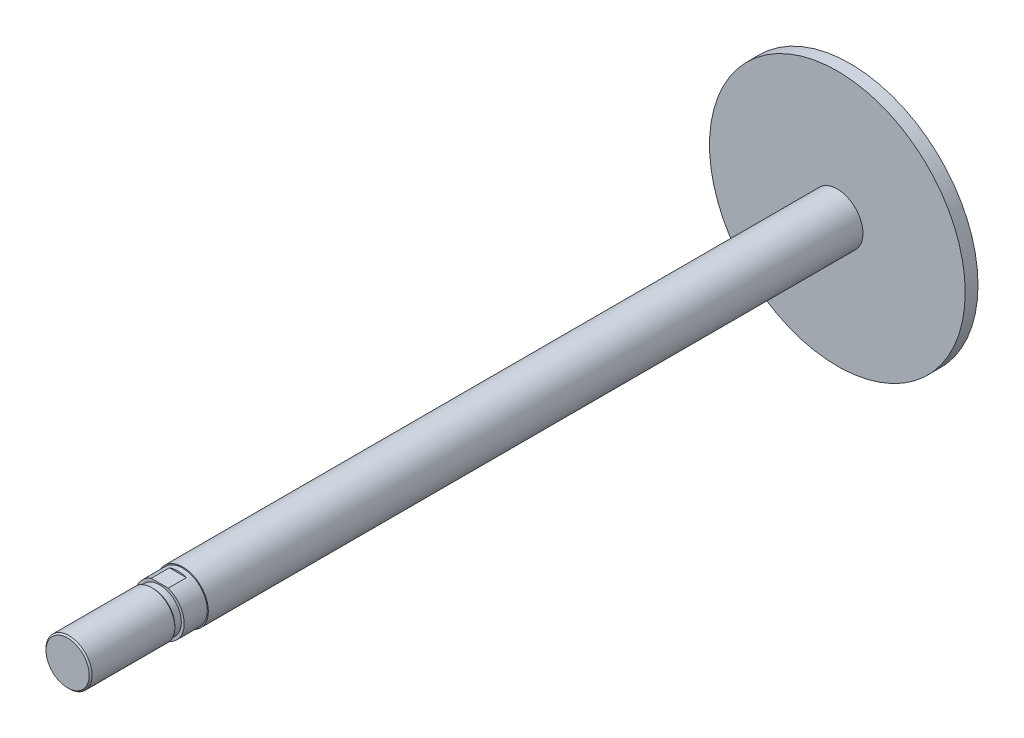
ISO-10303-21;
HEADER;
FILE_DESCRIPTION(('STEP AP214'),'2;1');
FILE_NAME('part.step','',(''),(''),'','','');
FILE_SCHEMA(('AUTOMOTIVE_DESIGN { 1 0 10303 214 1 1 1 1 }'));
ENDSEC;
DATA;
#1=APPLICATION_CONTEXT('core data for automotive mechanical design processes');
#2=APPLICATION_PROTOCOL_DEFINITION('international standard','automotive_design',2000,#1);
#3=PRODUCT_CONTEXT('',#1,'mechanical');
#4=PRODUCT('Part','Part','',(#3));
#5=PRODUCT_RELATED_PRODUCT_CATEGORY('part','',(#4));
#6=PRODUCT_DEFINITION_FORMATION('','',#4);
#7=PRODUCT_DEFINITION_CONTEXT('part definition',#1,'design');
#8=PRODUCT_DEFINITION('design','',#6,#7);
#9=PRODUCT_DEFINITION_SHAPE('','',#8);
#10=(LENGTH_UNIT() NAMED_UNIT(*) SI_UNIT(.MILLI.,.METRE.));
#11=(NAMED_UNIT(*) PLANE_ANGLE_UNIT() SI_UNIT($,.RADIAN.));
#12=(NAMED_UNIT(*) SI_UNIT($,.STERADIAN.) SOLID_ANGLE_UNIT());
#13=UNCERTAINTY_MEASURE_WITH_UNIT(LENGTH_MEASURE(1.E-05),#10,'distance_accuracy_value','');
#14=(GEOMETRIC_REPRESENTATION_CONTEXT(3) GLOBAL_UNCERTAINTY_ASSIGNED_CONTEXT((#13)) GLOBAL_UNIT_ASSIGNED_CONTEXT((#10,
#11,#12)) REPRESENTATION_CONTEXT('',''));
#15=CARTESIAN_POINT('',(0.,0.,0.));
#16=DIRECTION('',(0.,0.,1.));
#17=DIRECTION('',(1.,0.,0.));
#18=AXIS2_PLACEMENT_3D('',#15,#16,#17);
#19=CARTESIAN_POINT('',(0.,-10.,-445.));
#20=DIRECTION('',(0.,0.,-1.));
#21=DIRECTION('',(0.,-1.,0.));
#22=AXIS2_PLACEMENT_3D('',#19,#20,#21);
#23=PLANE('',#22);
#24=CARTESIAN_POINT('',(0.,0.,-445.));
#25=DIRECTION('',(0.,0.,-1.));
#26=DIRECTION('',(1.,0.,0.));
#27=AXIS2_PLACEMENT_3D('',#24,#25,#26);
#28=CIRCLE('',#27,100.);
#29=CARTESIAN_POINT('',(100.,0.,-445.));
#30=VERTEX_POINT('',#29);
#31=EDGE_CURVE('E97',#30,#30,#28,.T.);
#32=ORIENTED_EDGE('',*,*,#31,.T.);
#33=EDGE_LOOP('',(#32));
#34=FACE_BOUND('',#33,.T.);
#35=ADVANCED_FACE('F16',(#34),#23,.T.);
#36=CARTESIAN_POINT('',(0.,0.,-184.025));
#37=DIRECTION('',(0.,0.,1.));
#38=DIRECTION('',(0.,-1.,0.));
#39=AXIS2_PLACEMENT_3D('',#36,#37,#38);
#40=CYLINDRICAL_SURFACE('',#39,20.);
#41=CARTESIAN_POINT('',(0.,0.,76.95));
#42=DIRECTION('',(0.,0.,-1.));
#43=DIRECTION('',(0.,-1.,0.));
#44=AXIS2_PLACEMENT_3D('',#41,#42,#43);
#45=CIRCLE('',#44,20.);
#46=CARTESIAN_POINT('',(0.,-20.,76.95));
#47=VERTEX_POINT('',#46);
#48=EDGE_CURVE('E11',#47,#47,#45,.T.);
#49=ORIENTED_EDGE('',*,*,#48,.T.);
#50=EDGE_LOOP('',(#49));
#51=FACE_BOUND('',#50,.T.);
#52=CARTESIAN_POINT('',(0.,0.,-435.));
#53=DIRECTION('',(0.,0.,1.));
#54=DIRECTION('',(0.,-1.,0.));
#55=AXIS2_PLACEMENT_3D('',#52,#53,#54);
#56=CIRCLE('',#55,20.);
#57=CARTESIAN_POINT('',(0.,20.,-435.));
#58=VERTEX_POINT('',#57);
#59=EDGE_CURVE('E95',#58,#58,#56,.T.);
#60=ORIENTED_EDGE('',*,*,#59,.T.);
#61=EDGE_LOOP('',(#60));
#62=FACE_BOUND('',#61,.T.);
#63=ADVANCED_FACE('F161',(#51,#62),#40,.T.);
#64=CARTESIAN_POINT('',(0.,-19.6,76.95));
#65=DIRECTION('',(0.,0.,1.));
#66=DIRECTION('',(0.,1.,0.));
#67=AXIS2_PLACEMENT_3D('',#64,#65,#66);
#68=PLANE('',#67);
#69=CARTESIAN_POINT('',(0.,0.,76.95));
#70=DIRECTION('',(0.,0.,-1.));
#71=DIRECTION('',(0.,-1.,0.));
#72=AXIS2_PLACEMENT_3D('',#69,#70,#71);
#73=CIRCLE('',#72,19.2);
#74=CARTESIAN_POINT('',(0.,-19.2,76.95));
#75=VERTEX_POINT('',#74);
#76=EDGE_CURVE('E50',#75,#75,#73,.T.);
#77=ORIENTED_EDGE('',*,*,#76,.T.);
#78=EDGE_LOOP('',(#77));
#79=FACE_BOUND('',#78,.T.);
#80=ORIENTED_EDGE('',*,*,#48,.F.);
#81=EDGE_LOOP('',(#80));
#82=FACE_BOUND('',#81,.T.);
#83=ADVANCED_FACE('F166',(#79,#82),#68,.T.);
#84=CARTESIAN_POINT('',(0.,0.,97.52));
#85=DIRECTION('',(0.,0.,1.));
#86=DIRECTION('',(0.,-1.,0.));
#87=AXIS2_PLACEMENT_3D('',#84,#85,#86);
#88=CYLINDRICAL_SURFACE('',#87,16.9175);
#89=CARTESIAN_POINT('',(0.,0.,100.04));
#90=DIRECTION('',(0.,0.,-1.));
#91=DIRECTION('',(0.,-1.,0.));
#92=AXIS2_PLACEMENT_3D('',#89,#90,#91);
#93=CIRCLE('',#92,16.9175);
#94=CARTESIAN_POINT('',(0.,-16.9175,100.04));
#95=VERTEX_POINT('',#94);
#96=EDGE_CURVE('E26',#95,#95,#93,.T.);
#97=ORIENTED_EDGE('',*,*,#96,.T.);
#98=EDGE_LOOP('',(#97));
#99=FACE_BOUND('',#98,.T.);
#100=CARTESIAN_POINT('',(0.,0.,95.));
#101=DIRECTION('',(0.,0.,-1.));
#102=DIRECTION('',(0.,-1.,0.));
#103=AXIS2_PLACEMENT_3D('',#100,#101,#102);
#104=CIRCLE('',#103,16.9175);
#105=CARTESIAN_POINT('',(0.,-16.9175,95.));
#106=VERTEX_POINT('',#105);
#107=EDGE_CURVE('E98',#106,#106,#104,.T.);
#108=ORIENTED_EDGE('',*,*,#107,.F.);
#109=EDGE_LOOP('',(#108));
#110=FACE_BOUND('',#109,.T.);
#111=ADVANCED_FACE('F202',(#99,#110),#88,.T.);
#112=CARTESIAN_POINT('',(0.,0.,100.58125));
#113=DIRECTION('',(0.,0.,1.));
#114=DIRECTION('',(0.,-1.,0.));
#115=AXIS2_PLACEMENT_3D('',#112,#113,#114);
#116=CONICAL_SURFACE('',#115,17.45875,0.78539816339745);
#117=CARTESIAN_POINT('',(0.,0.,101.1225));
#118=DIRECTION('',(0.,0.,-1.));
#119=DIRECTION('',(0.,-1.,0.));
#120=AXIS2_PLACEMENT_3D('',#117,#118,#119);
#121=CIRCLE('',#120,18.);
#122=CARTESIAN_POINT('',(0.,-18.,101.1225));
#123=VERTEX_POINT('',#122);
#124=EDGE_CURVE('E103',#123,#123,#121,.T.);
#125=ORIENTED_EDGE('',*,*,#124,.T.);
#126=EDGE_LOOP('',(#125));
#127=FACE_BOUND('',#126,.T.);
#128=ORIENTED_EDGE('',*,*,#96,.F.);
#129=EDGE_LOOP('',(#128));
#130=FACE_BOUND('',#129,.T.);
#131=ADVANCED_FACE('F198',(#127,#130),#116,.T.);
#132=CARTESIAN_POINT('',(0.,0.,133.52));
#133=DIRECTION('',(0.,0.,1.));
#134=DIRECTION('',(0.,-1.,0.));
#135=AXIS2_PLACEMENT_3D('',#132,#133,#134);
#136=CYLINDRICAL_SURFACE('',#135,18.);
#137=CARTESIAN_POINT('',(0.,0.,165.9175));
#138=DIRECTION('',(0.,0.,-1.));
#139=DIRECTION('',(0.,-1.,0.));
#140=AXIS2_PLACEMENT_3D('',#137,#138,#139);
#141=CIRCLE('',#140,18.);
#142=CARTESIAN_POINT('',(0.,-18.,165.9175));
#143=VERTEX_POINT('',#142);
#144=EDGE_CURVE('E107',#143,#143,#141,.T.);
#145=ORIENTED_EDGE('',*,*,#144,.T.);
#146=EDGE_LOOP('',(#145));
#147=FACE_BOUND('',#146,.T.);
#148=ORIENTED_EDGE('',*,*,#124,.F.);
#149=EDGE_LOOP('',(#148));
#150=FACE_BOUND('',#149,.T.);
#151=ADVANCED_FACE('F192',(#147,#150),#136,.T.);
#152=CARTESIAN_POINT('',(0.,0.,166.45875));
#153=DIRECTION('',(0.,0.,-1.));
#154=DIRECTION('',(0.,-1.,0.));
#155=AXIS2_PLACEMENT_3D('',#152,#153,#154);
#156=CONICAL_SURFACE('',#155,17.45875,0.785398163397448);
#157=CARTESIAN_POINT('',(0.,0.,167.));
#158=DIRECTION('',(0.,0.,-1.));
#159=DIRECTION('',(0.,-1.,0.));
#160=AXIS2_PLACEMENT_3D('',#157,#158,#159);
#161=CIRCLE('',#160,16.9175);
#162=CARTESIAN_POINT('',(0.,-16.9175,167.));
#163=VERTEX_POINT('',#162);
#164=EDGE_CURVE('E112',#163,#163,#161,.T.);
#165=ORIENTED_EDGE('',*,*,#164,.T.);
#166=EDGE_LOOP('',(#165));
#167=FACE_BOUND('',#166,.T.);
#168=ORIENTED_EDGE('',*,*,#144,.F.);
#169=EDGE_LOOP('',(#168));
#170=FACE_BOUND('',#169,.T.);
#171=ADVANCED_FACE('F155',(#167,#170),#156,.T.);
#172=CARTESIAN_POINT('',(0.,-8.45875,167.));
#173=DIRECTION('',(0.,0.,1.));
#174=DIRECTION('',(0.,1.,0.));
#175=AXIS2_PLACEMENT_3D('',#172,#173,#174);
#176=PLANE('',#175);
#177=ORIENTED_EDGE('',*,*,#164,.F.);
#178=EDGE_LOOP('',(#177));
#179=FACE_BOUND('',#178,.T.);
#180=ADVANCED_FACE('F146',(#179),#176,.T.);
#181=CARTESIAN_POINT('',(0.,0.,-440.));
#182=DIRECTION('',(0.,0.,-1.));
#183=DIRECTION('',(1.,0.,0.));
#184=AXIS2_PLACEMENT_3D('',#181,#182,#183);
#185=CYLINDRICAL_SURFACE('',#184,100.);
#186=CARTESIAN_POINT('',(0.,0.,-435.));
#187=DIRECTION('',(0.,0.,1.));
#188=DIRECTION('',(1.,0.,0.));
#189=AXIS2_PLACEMENT_3D('',#186,#187,#188);
#190=CIRCLE('',#189,100.);
#191=CARTESIAN_POINT('',(100.,0.,-435.));
#192=VERTEX_POINT('',#191);
#193=EDGE_CURVE('E42',#192,#192,#190,.T.);
#194=ORIENTED_EDGE('',*,*,#193,.F.);
#195=EDGE_LOOP('',(#194));
#196=FACE_BOUND('',#195,.T.);
#197=ORIENTED_EDGE('',*,*,#31,.F.);
#198=EDGE_LOOP('',(#197));
#199=FACE_BOUND('',#198,.T.);
#200=ADVANCED_FACE('F144',(#196,#199),#185,.T.);
#201=CARTESIAN_POINT('',(0.,0.,-435.));
#202=DIRECTION('',(0.,0.,1.));
#203=DIRECTION('',(1.,0.,0.));
#204=AXIS2_PLACEMENT_3D('',#201,#202,#203);
#205=PLANE('',#204);
#206=ORIENTED_EDGE('',*,*,#59,.F.);
#207=EDGE_LOOP('',(#206));
#208=FACE_BOUND('',#207,.T.);
#209=ORIENTED_EDGE('',*,*,#193,.T.);
#210=EDGE_LOOP('',(#209));
#211=FACE_BOUND('',#210,.T.);
#212=ADVANCED_FACE('F18',(#208,#211),#205,.T.);
#213=CARTESIAN_POINT('',(0.,0.,85.975));
#214=DIRECTION('',(0.,0.,1.));
#215=DIRECTION('',(0.,-1.,0.));
#216=AXIS2_PLACEMENT_3D('',#213,#214,#215);
#217=CYLINDRICAL_SURFACE('',#216,19.2);
#218=ORIENTED_EDGE('',*,*,#76,.F.);
#219=EDGE_LOOP('',(#218));
#220=FACE_BOUND('',#219,.T.);
#221=DIRECTION('',(0.,0.,1.));
#222=VECTOR('',#221,1.);
#223=CARTESIAN_POINT('',(6.68131723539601,18.,87.875));
#224=LINE('',#223,#222);
#225=CARTESIAN_POINT('',(6.68131723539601,18.,80.75));
#226=VERTEX_POINT('',#225);
#227=CARTESIAN_POINT('',(6.68131723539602,18.,95.));
#228=VERTEX_POINT('',#227);
#229=EDGE_CURVE('E129',#226,#228,#224,.T.);
#230=ORIENTED_EDGE('',*,*,#229,.T.);
#231=CARTESIAN_POINT('',(0.,0.,95.));
#232=DIRECTION('',(0.,0.,-1.));
#233=DIRECTION('',(0.,-1.,0.));
#234=AXIS2_PLACEMENT_3D('',#231,#232,#233);
#235=CIRCLE('',#234,19.2);
#236=CARTESIAN_POINT('',(6.68131723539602,-18.,95.));
#237=VERTEX_POINT('',#236);
#238=EDGE_CURVE('E20',#228,#237,#235,.T.);
#239=ORIENTED_EDGE('',*,*,#238,.T.);
#240=DIRECTION('',(0.,0.,-1.));
#241=VECTOR('',#240,1.);
#242=CARTESIAN_POINT('',(6.68131723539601,-18.,87.875));
#243=LINE('',#242,#241);
#244=CARTESIAN_POINT('',(6.68131723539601,-18.,80.75));
#245=VERTEX_POINT('',#244);
#246=EDGE_CURVE('E69',#237,#245,#243,.T.);
#247=ORIENTED_EDGE('',*,*,#246,.T.);
#248=CARTESIAN_POINT('',(0.,0.,80.75));
#249=DIRECTION('',(0.,0.,-1.));
#250=DIRECTION('',(0.,-1.,0.));
#251=AXIS2_PLACEMENT_3D('',#248,#249,#250);
#252=CIRCLE('',#251,19.2);
#253=CARTESIAN_POINT('',(-6.68131723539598,-18.,80.75));
#254=VERTEX_POINT('',#253);
#255=EDGE_CURVE('E75',#245,#254,#252,.T.);
#256=ORIENTED_EDGE('',*,*,#255,.T.);
#257=DIRECTION('',(0.,0.,1.));
#258=VECTOR('',#257,1.);
#259=CARTESIAN_POINT('',(-6.68131723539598,-18.,87.875));
#260=LINE('',#259,#258);
#261=CARTESIAN_POINT('',(-6.68131723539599,-18.,95.));
#262=VERTEX_POINT('',#261);
#263=EDGE_CURVE('E80',#254,#262,#260,.T.);
#264=ORIENTED_EDGE('',*,*,#263,.T.);
#265=CARTESIAN_POINT('',(0.,0.,95.));
#266=DIRECTION('',(0.,0.,-1.));
#267=DIRECTION('',(0.,-1.,0.));
#268=AXIS2_PLACEMENT_3D('',#265,#266,#267);
#269=CIRCLE('',#268,19.2);
#270=CARTESIAN_POINT('',(-6.68131723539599,18.,95.));
#271=VERTEX_POINT('',#270);
#272=EDGE_CURVE('E101',#262,#271,#269,.T.);
#273=ORIENTED_EDGE('',*,*,#272,.T.);
#274=DIRECTION('',(0.,0.,-1.));
#275=VECTOR('',#274,1.);
#276=CARTESIAN_POINT('',(-6.68131723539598,18.,87.875));
#277=LINE('',#276,#275);
#278=CARTESIAN_POINT('',(-6.68131723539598,18.,80.75));
#279=VERTEX_POINT('',#278);
#280=EDGE_CURVE('E92',#271,#279,#277,.T.);
#281=ORIENTED_EDGE('',*,*,#280,.T.);
#282=CARTESIAN_POINT('',(0.,0.,80.75));
#283=DIRECTION('',(0.,0.,-1.));
#284=DIRECTION('',(0.,-1.,0.));
#285=AXIS2_PLACEMENT_3D('',#282,#283,#284);
#286=CIRCLE('',#285,19.2);
#287=EDGE_CURVE('E102',#279,#226,#286,.T.);
#288=ORIENTED_EDGE('',*,*,#287,.T.);
#289=EDGE_LOOP('',(#230,#239,#247,#256,#264,#273,#281,#288));
#290=FACE_BOUND('',#289,.T.);
#291=ADVANCED_FACE('F72',(#220,#290),#217,.T.);
#292=CARTESIAN_POINT('',(0.,-18.,92.625));
#293=DIRECTION('',(0.,-1.,0.));
#294=DIRECTION('',(0.,0.,-1.));
#295=AXIS2_PLACEMENT_3D('',#292,#293,#294);
#296=PLANE('',#295);
#297=ORIENTED_EDGE('',*,*,#246,.F.);
#298=DIRECTION('',(1.,0.,0.));
#299=VECTOR('',#298,1.);
#300=CARTESIAN_POINT('',(0.,-18.,95.));
#301=LINE('',#300,#299);
#302=EDGE_CURVE('E89',#262,#237,#301,.T.);
#303=ORIENTED_EDGE('',*,*,#302,.F.);
#304=ORIENTED_EDGE('',*,*,#263,.F.);
#305=DIRECTION('',(1.,0.,0.));
#306=VECTOR('',#305,1.);
#307=CARTESIAN_POINT('',(0.,-18.,80.75));
#308=LINE('',#307,#306);
#309=EDGE_CURVE('E81',#254,#245,#308,.T.);
#310=ORIENTED_EDGE('',*,*,#309,.T.);
#311=EDGE_LOOP('',(#297,#303,#304,#310));
#312=FACE_BOUND('',#311,.T.);
#313=ADVANCED_FACE('F84',(#312),#296,.T.);
#314=CARTESIAN_POINT('',(0.,-38.,80.75));
#315=DIRECTION('',(0.,0.,-1.));
#316=DIRECTION('',(1.,0.,0.));
#317=AXIS2_PLACEMENT_3D('',#314,#315,#316);
#318=PLANE('',#317);
#319=ORIENTED_EDGE('',*,*,#255,.F.);
#320=ORIENTED_EDGE('',*,*,#309,.F.);
#321=EDGE_LOOP('',(#319,#320));
#322=FACE_BOUND('',#321,.T.);
#323=ADVANCED_FACE('F87',(#322),#318,.F.);
#324=CARTESIAN_POINT('',(0.,-18.05875,95.));
#325=DIRECTION('',(0.,0.,1.));
#326=DIRECTION('',(0.,1.,0.));
#327=AXIS2_PLACEMENT_3D('',#324,#325,#326);
#328=PLANE('',#327);
#329=DIRECTION('',(-1.,0.,0.));
#330=VECTOR('',#329,1.);
#331=CARTESIAN_POINT('',(0.,18.,95.));
#332=LINE('',#331,#330);
#333=EDGE_CURVE('E120',#228,#271,#332,.T.);
#334=ORIENTED_EDGE('',*,*,#333,.T.);
#335=ORIENTED_EDGE('',*,*,#272,.F.);
#336=ORIENTED_EDGE('',*,*,#302,.T.);
#337=ORIENTED_EDGE('',*,*,#238,.F.);
#338=EDGE_LOOP('',(#334,#335,#336,#337));
#339=FACE_BOUND('',#338,.T.);
#340=ORIENTED_EDGE('',*,*,#107,.T.);
#341=EDGE_LOOP('',(#340));
#342=FACE_BOUND('',#341,.T.);
#343=ADVANCED_FACE('F177',(#339,#342),#328,.T.);
#344=CARTESIAN_POINT('',(0.,38.,80.75));
#345=DIRECTION('',(0.,0.,-1.));
#346=DIRECTION('',(-1.,0.,0.));
#347=AXIS2_PLACEMENT_3D('',#344,#345,#346);
#348=PLANE('',#347);
#349=ORIENTED_EDGE('',*,*,#287,.F.);
#350=DIRECTION('',(-1.,0.,0.));
#351=VECTOR('',#350,1.);
#352=CARTESIAN_POINT('',(0.,18.,80.75));
#353=LINE('',#352,#351);
#354=EDGE_CURVE('E127',#226,#279,#353,.T.);
#355=ORIENTED_EDGE('',*,*,#354,.F.);
#356=EDGE_LOOP('',(#349,#355));
#357=FACE_BOUND('',#356,.T.);
#358=ADVANCED_FACE('F170',(#357),#348,.F.);
#359=CARTESIAN_POINT('',(0.,18.,92.625));
#360=DIRECTION('',(0.,1.,0.));
#361=DIRECTION('',(0.,0.,-1.));
#362=AXIS2_PLACEMENT_3D('',#359,#360,#361);
#363=PLANE('',#362);
#364=ORIENTED_EDGE('',*,*,#229,.F.);
#365=ORIENTED_EDGE('',*,*,#354,.T.);
#366=ORIENTED_EDGE('',*,*,#280,.F.);
#367=ORIENTED_EDGE('',*,*,#333,.F.);
#368=EDGE_LOOP('',(#364,#365,#366,#367));
#369=FACE_BOUND('',#368,.T.);
#370=ADVANCED_FACE('F172',(#369),#363,.T.);
#371=CLOSED_SHELL('',(#35,#63,#83,#111,#131,#151,#171,#180,#200,#212,#291,#313,#323,#343,#358,#370));
#372=MANIFOLD_SOLID_BREP('B1',#371);
#373=ADVANCED_BREP_SHAPE_REPRESENTATION('',(#18,#372),#14);
#374=SHAPE_DEFINITION_REPRESENTATION(#9,#373);
ENDSEC;
END-ISO-10303-21;
